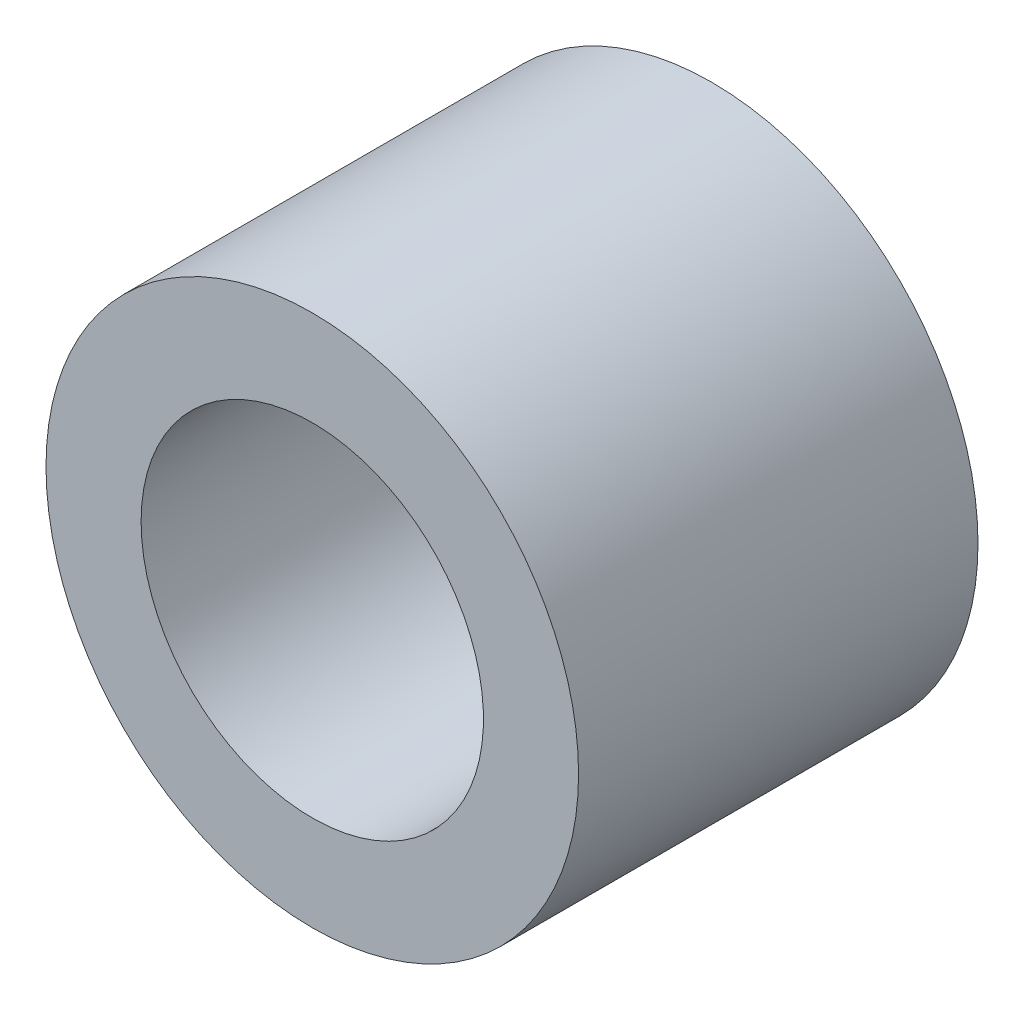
from build123d import *

# Parameters (mm, degrees)
SCHIZZO1_R                   = 28
SCHIZZO1_R_2                 = 18
ESTRUSIONE_ESTRUSIONE1_DEPTH = 21


with BuildPart() as part:
    # Schizzo1 → Estrusione-Estrusione1 (new, symmetric)
    with BuildSketch(Plane.XY):
        with Locations(Location((0, 0, 0), (0, 0, 180))):
            Circle(SCHIZZO1_R)
        with Locations(Location((0, 0, 0), (0, 0, 180))):
            Circle(SCHIZZO1_R_2, mode=Mode.SUBTRACT)
    extrude(amount=ESTRUSIONE_ESTRUSIONE1_DEPTH, both=True)


solid = part.part
